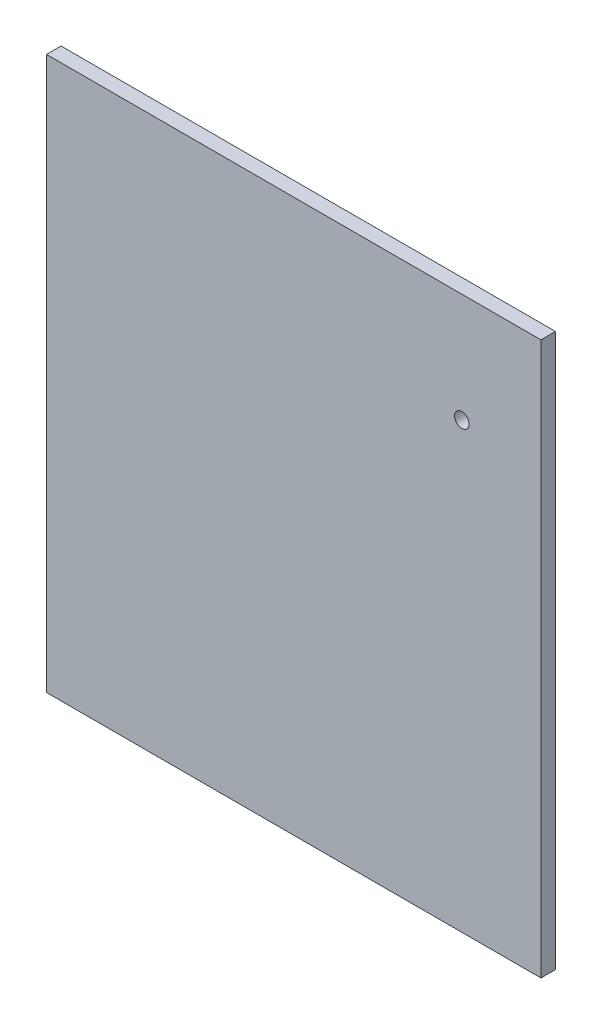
from build123d import *

# Parameters (mm, degrees)
SKETCH1_W           = 431.8
SKETCH1_H           = 482.6
BOSS_EXTRUDE1_DEPTH = 12.7
SKETCH2_R           = 6.35
CUT_EXTRUDE1_DEPTH  = 35.56


with BuildPart() as part:
    # Sketch1 → Boss-Extrude1 (new body)
    with BuildSketch(Plane.XY):
        with Locations((215.9, -241.3)):
            Rectangle(SKETCH1_W, SKETCH1_H)
    extrude(amount=BOSS_EXTRUDE1_DEPTH)

    # Sketch2 → Cut-Extrude1 (cut)
    with BuildSketch(Plane.XY.offset(12.7)):
        with Locations((362.709181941, -95.120817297)):
            Circle(SKETCH2_R)
    extrude(amount=-CUT_EXTRUDE1_DEPTH, mode=Mode.SUBTRACT)


solid = part.part
